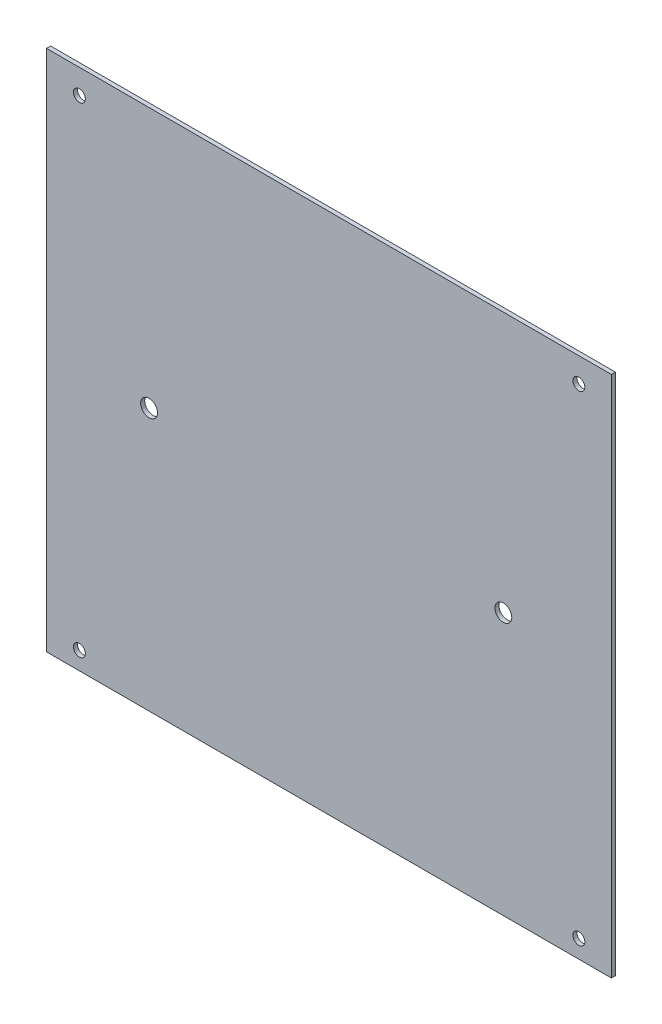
ISO-10303-21;
HEADER;
FILE_DESCRIPTION(('STEP AP214'),'2;1');
FILE_NAME('part.step','',(''),(''),'','','');
FILE_SCHEMA(('AUTOMOTIVE_DESIGN { 1 0 10303 214 1 1 1 1 }'));
ENDSEC;
DATA;
#1=APPLICATION_CONTEXT('core data for automotive mechanical design processes');
#2=APPLICATION_PROTOCOL_DEFINITION('international standard','automotive_design',2000,#1);
#3=PRODUCT_CONTEXT('',#1,'mechanical');
#4=PRODUCT('Part','Part','',(#3));
#5=PRODUCT_RELATED_PRODUCT_CATEGORY('part','',(#4));
#6=PRODUCT_DEFINITION_FORMATION('','',#4);
#7=PRODUCT_DEFINITION_CONTEXT('part definition',#1,'design');
#8=PRODUCT_DEFINITION('design','',#6,#7);
#9=PRODUCT_DEFINITION_SHAPE('','',#8);
#10=(LENGTH_UNIT() NAMED_UNIT(*) SI_UNIT(.MILLI.,.METRE.));
#11=(NAMED_UNIT(*) PLANE_ANGLE_UNIT() SI_UNIT($,.RADIAN.));
#12=(NAMED_UNIT(*) SI_UNIT($,.STERADIAN.) SOLID_ANGLE_UNIT());
#13=UNCERTAINTY_MEASURE_WITH_UNIT(LENGTH_MEASURE(1.E-05),#10,'distance_accuracy_value','');
#14=(GEOMETRIC_REPRESENTATION_CONTEXT(3) GLOBAL_UNCERTAINTY_ASSIGNED_CONTEXT((#13)) GLOBAL_UNIT_ASSIGNED_CONTEXT((#10,
#11,#12)) REPRESENTATION_CONTEXT('',''));
#15=CARTESIAN_POINT('',(0.,0.,0.));
#16=DIRECTION('',(0.,0.,1.));
#17=DIRECTION('',(1.,0.,0.));
#18=AXIS2_PLACEMENT_3D('',#15,#16,#17);
#19=CARTESIAN_POINT('',(0.,0.,2.));
#20=DIRECTION('',(1.,0.,0.));
#21=DIRECTION('',(0.,0.,-1.));
#22=AXIS2_PLACEMENT_3D('',#19,#20,#21);
#23=PLANE('',#22);
#24=DIRECTION('',(0.,0.,-1.));
#25=VECTOR('',#24,1.);
#26=CARTESIAN_POINT('',(0.,0.,2.));
#27=LINE('',#26,#25);
#28=CARTESIAN_POINT('',(0.,0.,0.700000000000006));
#29=VERTEX_POINT('',#28);
#30=CARTESIAN_POINT('',(0.,0.,0.));
#31=VERTEX_POINT('',#30);
#32=EDGE_CURVE('E12',#29,#31,#27,.T.);
#33=ORIENTED_EDGE('',*,*,#32,.F.);
#34=DIRECTION('',(0.,-1.,0.));
#35=VECTOR('',#34,1.);
#36=CARTESIAN_POINT('',(0.,90.,0.700000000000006));
#37=LINE('',#36,#35);
#38=CARTESIAN_POINT('',(0.,90.,0.700000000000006));
#39=VERTEX_POINT('',#38);
#40=EDGE_CURVE('E79',#39,#29,#37,.T.);
#41=ORIENTED_EDGE('',*,*,#40,.F.);
#42=DIRECTION('',(0.,0.,-1.));
#43=VECTOR('',#42,1.);
#44=CARTESIAN_POINT('',(0.,90.,2.));
#45=LINE('',#44,#43);
#46=CARTESIAN_POINT('',(0.,90.,0.));
#47=VERTEX_POINT('',#46);
#48=EDGE_CURVE('E59',#39,#47,#45,.T.);
#49=ORIENTED_EDGE('',*,*,#48,.T.);
#50=DIRECTION('',(0.,-1.,0.));
#51=VECTOR('',#50,1.);
#52=CARTESIAN_POINT('',(0.,0.,0.));
#53=LINE('',#52,#51);
#54=EDGE_CURVE('E105',#47,#31,#53,.T.);
#55=ORIENTED_EDGE('',*,*,#54,.T.);
#56=EDGE_LOOP('',(#33,#41,#49,#55));
#57=FACE_BOUND('',#56,.T.);
#58=ADVANCED_FACE('F36',(#57),#23,.F.);
#59=CARTESIAN_POINT('',(0.,0.,2.));
#60=DIRECTION('',(0.,1.,0.));
#61=DIRECTION('',(0.,0.,1.));
#62=AXIS2_PLACEMENT_3D('',#59,#60,#61);
#63=PLANE('',#62);
#64=DIRECTION('',(0.,0.,-1.));
#65=VECTOR('',#64,1.);
#66=CARTESIAN_POINT('',(97.25,0.,2.));
#67=LINE('',#66,#65);
#68=CARTESIAN_POINT('',(97.25,0.,0.700000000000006));
#69=VERTEX_POINT('',#68);
#70=CARTESIAN_POINT('',(97.25,0.,0.));
#71=VERTEX_POINT('',#70);
#72=EDGE_CURVE('E44',#69,#71,#67,.T.);
#73=ORIENTED_EDGE('',*,*,#72,.F.);
#74=DIRECTION('',(1.,0.,0.));
#75=VECTOR('',#74,1.);
#76=CARTESIAN_POINT('',(0.,0.,0.700000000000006));
#77=LINE('',#76,#75);
#78=EDGE_CURVE('E76',#29,#69,#77,.T.);
#79=ORIENTED_EDGE('',*,*,#78,.F.);
#80=ORIENTED_EDGE('',*,*,#32,.T.);
#81=DIRECTION('',(1.,0.,0.));
#82=VECTOR('',#81,1.);
#83=CARTESIAN_POINT('',(0.,0.,0.));
#84=LINE('',#83,#82);
#85=EDGE_CURVE('E94',#31,#71,#84,.T.);
#86=ORIENTED_EDGE('',*,*,#85,.T.);
#87=EDGE_LOOP('',(#73,#79,#80,#86));
#88=FACE_BOUND('',#87,.T.);
#89=ADVANCED_FACE('F92',(#88),#63,.F.);
#90=CARTESIAN_POINT('',(97.25,0.,2.));
#91=DIRECTION('',(-1.,0.,0.));
#92=DIRECTION('',(0.,0.,1.));
#93=AXIS2_PLACEMENT_3D('',#90,#91,#92);
#94=PLANE('',#93);
#95=DIRECTION('',(0.,0.,-1.));
#96=VECTOR('',#95,1.);
#97=CARTESIAN_POINT('',(97.25,90.,2.));
#98=LINE('',#97,#96);
#99=CARTESIAN_POINT('',(97.25,90.,0.700000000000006));
#100=VERTEX_POINT('',#99);
#101=CARTESIAN_POINT('',(97.25,90.,0.));
#102=VERTEX_POINT('',#101);
#103=EDGE_CURVE('E89',#100,#102,#98,.T.);
#104=ORIENTED_EDGE('',*,*,#103,.F.);
#105=DIRECTION('',(0.,1.,0.));
#106=VECTOR('',#105,1.);
#107=CARTESIAN_POINT('',(97.25,90.,0.700000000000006));
#108=LINE('',#107,#106);
#109=EDGE_CURVE('E51',#69,#100,#108,.T.);
#110=ORIENTED_EDGE('',*,*,#109,.F.);
#111=ORIENTED_EDGE('',*,*,#72,.T.);
#112=DIRECTION('',(0.,1.,0.));
#113=VECTOR('',#112,1.);
#114=CARTESIAN_POINT('',(97.25,0.,0.));
#115=LINE('',#114,#113);
#116=EDGE_CURVE('E102',#71,#102,#115,.T.);
#117=ORIENTED_EDGE('',*,*,#116,.T.);
#118=EDGE_LOOP('',(#104,#110,#111,#117));
#119=FACE_BOUND('',#118,.T.);
#120=ADVANCED_FACE('F86',(#119),#94,.F.);
#121=CARTESIAN_POINT('',(0.,90.,2.));
#122=DIRECTION('',(0.,-1.,0.));
#123=DIRECTION('',(0.,0.,-1.));
#124=AXIS2_PLACEMENT_3D('',#121,#122,#123);
#125=PLANE('',#124);
#126=ORIENTED_EDGE('',*,*,#48,.F.);
#127=DIRECTION('',(-1.,0.,0.));
#128=VECTOR('',#127,1.);
#129=CARTESIAN_POINT('',(0.,90.,0.700000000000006));
#130=LINE('',#129,#128);
#131=EDGE_CURVE('E90',#100,#39,#130,.T.);
#132=ORIENTED_EDGE('',*,*,#131,.F.);
#133=ORIENTED_EDGE('',*,*,#103,.T.);
#134=DIRECTION('',(-1.,0.,0.));
#135=VECTOR('',#134,1.);
#136=CARTESIAN_POINT('',(0.,90.,0.));
#137=LINE('',#136,#135);
#138=EDGE_CURVE('E100',#102,#47,#137,.T.);
#139=ORIENTED_EDGE('',*,*,#138,.T.);
#140=EDGE_LOOP('',(#126,#132,#133,#139));
#141=FACE_BOUND('',#140,.T.);
#142=ADVANCED_FACE('F166',(#141),#125,.F.);
#143=CARTESIAN_POINT('',(0.,0.,0.));
#144=DIRECTION('',(0.,0.,-1.));
#145=DIRECTION('',(-1.,0.,0.));
#146=AXIS2_PLACEMENT_3D('',#143,#144,#145);
#147=PLANE('',#146);
#148=CARTESIAN_POINT('',(91.6499999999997,3.07999999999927,0.));
#149=DIRECTION('',(0.,0.,-1.));
#150=DIRECTION('',(-1.,0.,0.));
#151=AXIS2_PLACEMENT_3D('',#148,#149,#150);
#152=CIRCLE('',#151,1.02499999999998);
#153=CARTESIAN_POINT('',(90.6249999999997,3.07999999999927,0.));
#154=VERTEX_POINT('',#153);
#155=EDGE_CURVE('E122',#154,#154,#152,.T.);
#156=ORIENTED_EDGE('',*,*,#155,.F.);
#157=EDGE_LOOP('',(#156));
#158=FACE_BOUND('',#157,.T.);
#159=CARTESIAN_POINT('',(5.64999999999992,3.07999999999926,0.));
#160=DIRECTION('',(0.,0.,-1.));
#161=DIRECTION('',(-1.,0.,0.));
#162=AXIS2_PLACEMENT_3D('',#159,#160,#161);
#163=CIRCLE('',#162,1.02499999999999);
#164=CARTESIAN_POINT('',(4.62499999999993,3.07999999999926,0.));
#165=VERTEX_POINT('',#164);
#166=EDGE_CURVE('E119',#165,#165,#163,.T.);
#167=ORIENTED_EDGE('',*,*,#166,.F.);
#168=EDGE_LOOP('',(#167));
#169=FACE_BOUND('',#168,.T.);
#170=CARTESIAN_POINT('',(5.64999999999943,85.7799999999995,0.));
#171=DIRECTION('',(0.,0.,-1.));
#172=DIRECTION('',(-1.,0.,0.));
#173=AXIS2_PLACEMENT_3D('',#170,#171,#172);
#174=CIRCLE('',#173,1.02499999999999);
#175=CARTESIAN_POINT('',(4.62499999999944,85.7799999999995,0.));
#176=VERTEX_POINT('',#175);
#177=EDGE_CURVE('E116',#176,#176,#174,.T.);
#178=ORIENTED_EDGE('',*,*,#177,.F.);
#179=EDGE_LOOP('',(#178));
#180=FACE_BOUND('',#179,.T.);
#181=CARTESIAN_POINT('',(91.6499999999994,85.7799999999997,0.));
#182=DIRECTION('',(0.,0.,-1.));
#183=DIRECTION('',(-1.,0.,0.));
#184=AXIS2_PLACEMENT_3D('',#181,#182,#183);
#185=CIRCLE('',#184,1.02499999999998);
#186=CARTESIAN_POINT('',(90.6249999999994,85.7799999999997,0.));
#187=VERTEX_POINT('',#186);
#188=EDGE_CURVE('E113',#187,#187,#185,.T.);
#189=ORIENTED_EDGE('',*,*,#188,.F.);
#190=EDGE_LOOP('',(#189));
#191=FACE_BOUND('',#190,.T.);
#192=CARTESIAN_POINT('',(78.6499999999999,45.1799999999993,0.));
#193=DIRECTION('',(0.,0.,1.));
#194=DIRECTION('',(1.,0.,0.));
#195=AXIS2_PLACEMENT_3D('',#192,#193,#194);
#196=CIRCLE('',#195,1.44999999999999);
#197=CARTESIAN_POINT('',(80.0999999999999,45.1799999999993,0.));
#198=VERTEX_POINT('',#197);
#199=EDGE_CURVE('E110',#198,#198,#196,.T.);
#200=ORIENTED_EDGE('',*,*,#199,.T.);
#201=EDGE_LOOP('',(#200));
#202=FACE_BOUND('',#201,.T.);
#203=CARTESIAN_POINT('',(17.6499999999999,45.1799999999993,0.));
#204=DIRECTION('',(0.,0.,1.));
#205=DIRECTION('',(1.,0.,0.));
#206=AXIS2_PLACEMENT_3D('',#203,#204,#205);
#207=CIRCLE('',#206,1.45);
#208=CARTESIAN_POINT('',(19.0999999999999,45.1799999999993,0.));
#209=VERTEX_POINT('',#208);
#210=EDGE_CURVE('E107',#209,#209,#207,.T.);
#211=ORIENTED_EDGE('',*,*,#210,.T.);
#212=EDGE_LOOP('',(#211));
#213=FACE_BOUND('',#212,.T.);
#214=ORIENTED_EDGE('',*,*,#54,.F.);
#215=ORIENTED_EDGE('',*,*,#138,.F.);
#216=ORIENTED_EDGE('',*,*,#116,.F.);
#217=ORIENTED_EDGE('',*,*,#85,.F.);
#218=EDGE_LOOP('',(#214,#215,#216,#217));
#219=FACE_BOUND('',#218,.T.);
#220=ADVANCED_FACE('F163',(#158,#169,#180,#191,#202,#213,#219),#147,.T.);
#221=CARTESIAN_POINT('',(17.6499999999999,45.1799999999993,2.));
#222=DIRECTION('',(0.,0.,1.));
#223=DIRECTION('',(1.,0.,0.));
#224=AXIS2_PLACEMENT_3D('',#221,#222,#223);
#225=CYLINDRICAL_SURFACE('',#224,1.44999999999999);
#226=ORIENTED_EDGE('',*,*,#210,.F.);
#227=EDGE_LOOP('',(#226));
#228=FACE_BOUND('',#227,.T.);
#229=CARTESIAN_POINT('',(17.6499999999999,45.1799999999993,0.7));
#230=DIRECTION('',(0.,0.,-1.));
#231=DIRECTION('',(-1.,0.,0.));
#232=AXIS2_PLACEMENT_3D('',#229,#230,#231);
#233=CIRCLE('',#232,1.45);
#234=CARTESIAN_POINT('',(16.1999999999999,45.1799999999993,0.7));
#235=VERTEX_POINT('',#234);
#236=EDGE_CURVE('E125',#235,#235,#233,.F.);
#237=ORIENTED_EDGE('',*,*,#236,.T.);
#238=EDGE_LOOP('',(#237));
#239=FACE_BOUND('',#238,.T.);
#240=ADVANCED_FACE('F173',(#228,#239),#225,.F.);
#241=CARTESIAN_POINT('',(78.6499999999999,45.1799999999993,2.));
#242=DIRECTION('',(0.,0.,1.));
#243=DIRECTION('',(1.,0.,0.));
#244=AXIS2_PLACEMENT_3D('',#241,#242,#243);
#245=CYLINDRICAL_SURFACE('',#244,1.44999999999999);
#246=ORIENTED_EDGE('',*,*,#199,.F.);
#247=EDGE_LOOP('',(#246));
#248=FACE_BOUND('',#247,.T.);
#249=CARTESIAN_POINT('',(78.6499999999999,45.1799999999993,0.7));
#250=DIRECTION('',(0.,0.,-1.));
#251=DIRECTION('',(-1.,0.,0.));
#252=AXIS2_PLACEMENT_3D('',#249,#250,#251);
#253=CIRCLE('',#252,1.45);
#254=CARTESIAN_POINT('',(77.1999999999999,45.1799999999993,0.7));
#255=VERTEX_POINT('',#254);
#256=EDGE_CURVE('E128',#255,#255,#253,.F.);
#257=ORIENTED_EDGE('',*,*,#256,.T.);
#258=EDGE_LOOP('',(#257));
#259=FACE_BOUND('',#258,.T.);
#260=ADVANCED_FACE('F180',(#248,#259),#245,.F.);
#261=CARTESIAN_POINT('',(91.6499999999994,85.7799999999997,0.));
#262=DIRECTION('',(0.,0.,-1.));
#263=DIRECTION('',(-1.,0.,0.));
#264=AXIS2_PLACEMENT_3D('',#261,#262,#263);
#265=CYLINDRICAL_SURFACE('',#264,1.02499999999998);
#266=CARTESIAN_POINT('',(91.6499999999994,85.7799999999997,0.7));
#267=DIRECTION('',(0.,0.,-1.));
#268=DIRECTION('',(-1.,0.,0.));
#269=AXIS2_PLACEMENT_3D('',#266,#267,#268);
#270=CIRCLE('',#269,1.02499999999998);
#271=CARTESIAN_POINT('',(90.6249999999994,85.7799999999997,0.7));
#272=VERTEX_POINT('',#271);
#273=EDGE_CURVE('E131',#272,#272,#270,.F.);
#274=ORIENTED_EDGE('',*,*,#273,.T.);
#275=EDGE_LOOP('',(#274));
#276=FACE_BOUND('',#275,.T.);
#277=ORIENTED_EDGE('',*,*,#188,.T.);
#278=EDGE_LOOP('',(#277));
#279=FACE_BOUND('',#278,.T.);
#280=ADVANCED_FACE('F184',(#276,#279),#265,.F.);
#281=CARTESIAN_POINT('',(5.64999999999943,85.7799999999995,0.));
#282=DIRECTION('',(0.,0.,-1.));
#283=DIRECTION('',(-1.,0.,0.));
#284=AXIS2_PLACEMENT_3D('',#281,#282,#283);
#285=CYLINDRICAL_SURFACE('',#284,1.02499999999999);
#286=CARTESIAN_POINT('',(5.64999999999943,85.7799999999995,0.7));
#287=DIRECTION('',(0.,0.,-1.));
#288=DIRECTION('',(-1.,0.,0.));
#289=AXIS2_PLACEMENT_3D('',#286,#287,#288);
#290=CIRCLE('',#289,1.02499999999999);
#291=CARTESIAN_POINT('',(4.62499999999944,85.7799999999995,0.7));
#292=VERTEX_POINT('',#291);
#293=EDGE_CURVE('E134',#292,#292,#290,.F.);
#294=ORIENTED_EDGE('',*,*,#293,.T.);
#295=EDGE_LOOP('',(#294));
#296=FACE_BOUND('',#295,.T.);
#297=ORIENTED_EDGE('',*,*,#177,.T.);
#298=EDGE_LOOP('',(#297));
#299=FACE_BOUND('',#298,.T.);
#300=ADVANCED_FACE('F188',(#296,#299),#285,.F.);
#301=CARTESIAN_POINT('',(5.64999999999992,3.07999999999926,0.));
#302=DIRECTION('',(0.,0.,-1.));
#303=DIRECTION('',(-1.,0.,0.));
#304=AXIS2_PLACEMENT_3D('',#301,#302,#303);
#305=CYLINDRICAL_SURFACE('',#304,1.02499999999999);
#306=CARTESIAN_POINT('',(5.64999999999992,3.07999999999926,0.7));
#307=DIRECTION('',(0.,0.,-1.));
#308=DIRECTION('',(-1.,0.,0.));
#309=AXIS2_PLACEMENT_3D('',#306,#307,#308);
#310=CIRCLE('',#309,1.02499999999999);
#311=CARTESIAN_POINT('',(4.62499999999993,3.07999999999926,0.7));
#312=VERTEX_POINT('',#311);
#313=EDGE_CURVE('E137',#312,#312,#310,.F.);
#314=ORIENTED_EDGE('',*,*,#313,.T.);
#315=EDGE_LOOP('',(#314));
#316=FACE_BOUND('',#315,.T.);
#317=ORIENTED_EDGE('',*,*,#166,.T.);
#318=EDGE_LOOP('',(#317));
#319=FACE_BOUND('',#318,.T.);
#320=ADVANCED_FACE('F153',(#316,#319),#305,.F.);
#321=CARTESIAN_POINT('',(91.6499999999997,3.07999999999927,0.));
#322=DIRECTION('',(0.,0.,-1.));
#323=DIRECTION('',(-1.,0.,0.));
#324=AXIS2_PLACEMENT_3D('',#321,#322,#323);
#325=CYLINDRICAL_SURFACE('',#324,1.02499999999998);
#326=CARTESIAN_POINT('',(91.6499999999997,3.07999999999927,0.7));
#327=DIRECTION('',(0.,0.,-1.));
#328=DIRECTION('',(-1.,0.,0.));
#329=AXIS2_PLACEMENT_3D('',#326,#327,#328);
#330=CIRCLE('',#329,1.02499999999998);
#331=CARTESIAN_POINT('',(90.6249999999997,3.07999999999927,0.7));
#332=VERTEX_POINT('',#331);
#333=EDGE_CURVE('E39',#332,#332,#330,.F.);
#334=ORIENTED_EDGE('',*,*,#333,.T.);
#335=EDGE_LOOP('',(#334));
#336=FACE_BOUND('',#335,.T.);
#337=ORIENTED_EDGE('',*,*,#155,.T.);
#338=EDGE_LOOP('',(#337));
#339=FACE_BOUND('',#338,.T.);
#340=ADVANCED_FACE('F144',(#336,#339),#325,.F.);
#341=CARTESIAN_POINT('',(0.,0.,0.7));
#342=DIRECTION('',(0.,0.,-1.));
#343=DIRECTION('',(-1.,0.,0.));
#344=AXIS2_PLACEMENT_3D('',#341,#342,#343);
#345=PLANE('',#344);
#346=ORIENTED_EDGE('',*,*,#256,.F.);
#347=EDGE_LOOP('',(#346));
#348=FACE_BOUND('',#347,.T.);
#349=ORIENTED_EDGE('',*,*,#293,.F.);
#350=EDGE_LOOP('',(#349));
#351=FACE_BOUND('',#350,.T.);
#352=ORIENTED_EDGE('',*,*,#333,.F.);
#353=EDGE_LOOP('',(#352));
#354=FACE_BOUND('',#353,.T.);
#355=ORIENTED_EDGE('',*,*,#40,.T.);
#356=ORIENTED_EDGE('',*,*,#78,.T.);
#357=ORIENTED_EDGE('',*,*,#109,.T.);
#358=ORIENTED_EDGE('',*,*,#131,.T.);
#359=EDGE_LOOP('',(#355,#356,#357,#358));
#360=FACE_BOUND('',#359,.T.);
#361=ORIENTED_EDGE('',*,*,#313,.F.);
#362=EDGE_LOOP('',(#361));
#363=FACE_BOUND('',#362,.T.);
#364=ORIENTED_EDGE('',*,*,#273,.F.);
#365=EDGE_LOOP('',(#364));
#366=FACE_BOUND('',#365,.T.);
#367=ORIENTED_EDGE('',*,*,#236,.F.);
#368=EDGE_LOOP('',(#367));
#369=FACE_BOUND('',#368,.T.);
#370=ADVANCED_FACE('F77',(#348,#351,#354,#360,#363,#366,#369),#345,.F.);
#371=CLOSED_SHELL('',(#58,#89,#120,#142,#220,#240,#260,#280,#300,#320,#340,#370));
#372=MANIFOLD_SOLID_BREP('B2',#371);
#373=ADVANCED_BREP_SHAPE_REPRESENTATION('',(#18,#372),#14);
#374=SHAPE_DEFINITION_REPRESENTATION(#9,#373);
ENDSEC;
END-ISO-10303-21;
